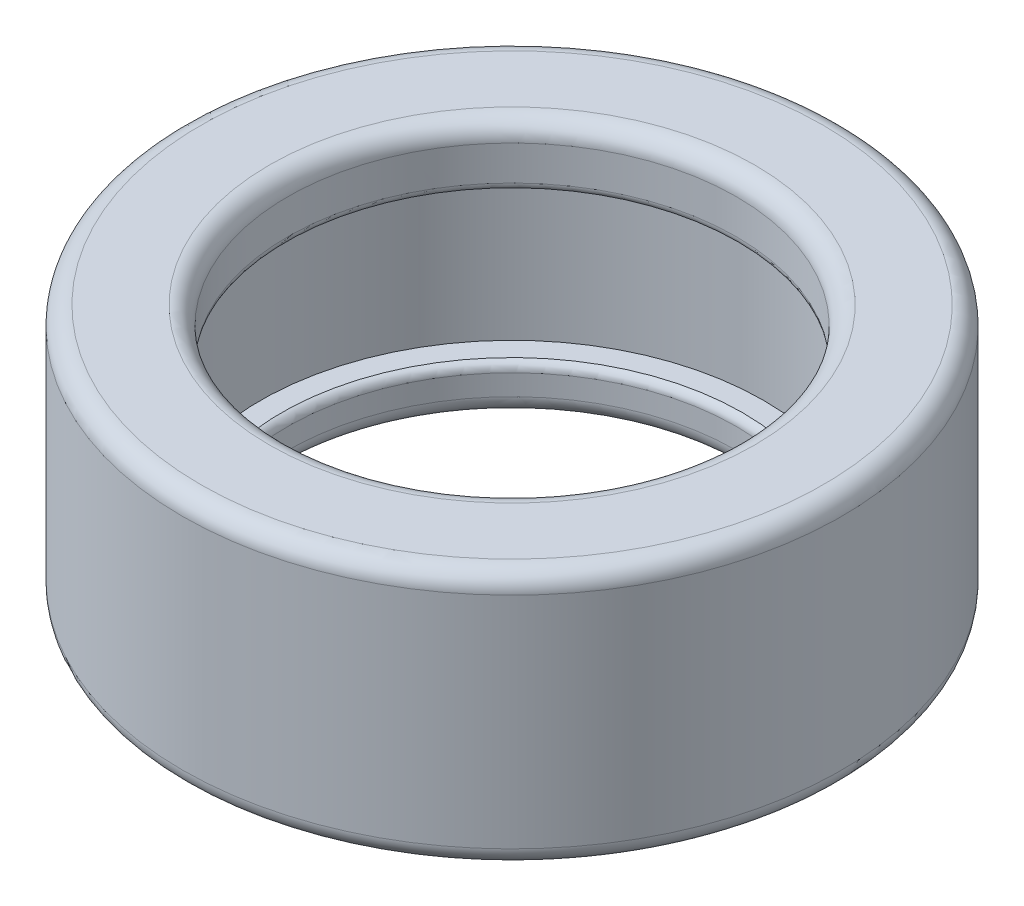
ISO-10303-21;
HEADER;
FILE_DESCRIPTION(('STEP AP214'),'2;1');
FILE_NAME('part.step','',(''),(''),'','','');
FILE_SCHEMA(('AUTOMOTIVE_DESIGN { 1 0 10303 214 1 1 1 1 }'));
ENDSEC;
DATA;
#1=APPLICATION_CONTEXT('core data for automotive mechanical design processes');
#2=APPLICATION_PROTOCOL_DEFINITION('international standard','automotive_design',2000,#1);
#3=PRODUCT_CONTEXT('',#1,'mechanical');
#4=PRODUCT('Part','Part','',(#3));
#5=PRODUCT_RELATED_PRODUCT_CATEGORY('part','',(#4));
#6=PRODUCT_DEFINITION_FORMATION('','',#4);
#7=PRODUCT_DEFINITION_CONTEXT('part definition',#1,'design');
#8=PRODUCT_DEFINITION('design','',#6,#7);
#9=PRODUCT_DEFINITION_SHAPE('','',#8);
#10=(LENGTH_UNIT() NAMED_UNIT(*) SI_UNIT(.MILLI.,.METRE.));
#11=(NAMED_UNIT(*) PLANE_ANGLE_UNIT() SI_UNIT($,.RADIAN.));
#12=(NAMED_UNIT(*) SI_UNIT($,.STERADIAN.) SOLID_ANGLE_UNIT());
#13=UNCERTAINTY_MEASURE_WITH_UNIT(LENGTH_MEASURE(1.E-05),#10,'distance_accuracy_value','');
#14=(GEOMETRIC_REPRESENTATION_CONTEXT(3) GLOBAL_UNCERTAINTY_ASSIGNED_CONTEXT((#13)) GLOBAL_UNIT_ASSIGNED_CONTEXT((#10,
#11,#12)) REPRESENTATION_CONTEXT('',''));
#15=CARTESIAN_POINT('',(0.,0.,0.));
#16=DIRECTION('',(0.,0.,1.));
#17=DIRECTION('',(1.,0.,0.));
#18=AXIS2_PLACEMENT_3D('',#15,#16,#17);
#19=CARTESIAN_POINT('',(0.,14.,0.));
#20=DIRECTION('',(0.,-1.,0.));
#21=DIRECTION('',(0.,0.,-1.));
#22=AXIS2_PLACEMENT_3D('',#19,#20,#21);
#23=CYLINDRICAL_SURFACE('',#22,18.);
#24=CARTESIAN_POINT('',(0.,13.,0.));
#25=DIRECTION('',(0.,1.,0.));
#26=DIRECTION('',(0.,0.,1.));
#27=AXIS2_PLACEMENT_3D('',#24,#25,#26);
#28=CIRCLE('',#27,18.);
#29=CARTESIAN_POINT('',(0.,13.,18.));
#30=VERTEX_POINT('',#29);
#31=EDGE_CURVE('E60',#30,#30,#28,.F.);
#32=ORIENTED_EDGE('',*,*,#31,.T.);
#33=EDGE_LOOP('',(#32));
#34=FACE_BOUND('',#33,.T.);
#35=CARTESIAN_POINT('',(0.,0.999999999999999,0.));
#36=DIRECTION('',(0.,1.,0.));
#37=DIRECTION('',(0.,0.,1.));
#38=AXIS2_PLACEMENT_3D('',#35,#36,#37);
#39=CIRCLE('',#38,18.);
#40=CARTESIAN_POINT('',(0.,0.999999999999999,18.));
#41=VERTEX_POINT('',#40);
#42=EDGE_CURVE('E63',#41,#41,#39,.T.);
#43=ORIENTED_EDGE('',*,*,#42,.T.);
#44=EDGE_LOOP('',(#43));
#45=FACE_BOUND('',#44,.T.);
#46=ADVANCED_FACE('F37',(#34,#45),#23,.T.);
#47=CARTESIAN_POINT('',(0.,14.,0.));
#48=DIRECTION('',(0.,1.,0.));
#49=DIRECTION('',(0.,0.,1.));
#50=AXIS2_PLACEMENT_3D('',#47,#48,#49);
#51=PLANE('',#50);
#52=CARTESIAN_POINT('',(0.,14.,0.));
#53=DIRECTION('',(0.,1.,0.));
#54=DIRECTION('',(0.,0.,1.));
#55=AXIS2_PLACEMENT_3D('',#52,#53,#54);
#56=CIRCLE('',#55,13.25);
#57=CARTESIAN_POINT('',(0.,14.,13.25));
#58=VERTEX_POINT('',#57);
#59=EDGE_CURVE('E52',#58,#58,#56,.F.);
#60=ORIENTED_EDGE('',*,*,#59,.T.);
#61=EDGE_LOOP('',(#60));
#62=FACE_BOUND('',#61,.T.);
#63=CARTESIAN_POINT('',(0.,14.,0.));
#64=DIRECTION('',(0.,1.,0.));
#65=DIRECTION('',(0.,0.,1.));
#66=AXIS2_PLACEMENT_3D('',#63,#64,#65);
#67=CIRCLE('',#66,17.);
#68=CARTESIAN_POINT('',(0.,14.,17.));
#69=VERTEX_POINT('',#68);
#70=EDGE_CURVE('E66',#69,#69,#67,.T.);
#71=ORIENTED_EDGE('',*,*,#70,.T.);
#72=EDGE_LOOP('',(#71));
#73=FACE_BOUND('',#72,.T.);
#74=ADVANCED_FACE('F103',(#62,#73),#51,.T.);
#75=CARTESIAN_POINT('',(0.,0.,0.));
#76=DIRECTION('',(0.,1.,0.));
#77=DIRECTION('',(0.,0.,1.));
#78=AXIS2_PLACEMENT_3D('',#75,#76,#77);
#79=PLANE('',#78);
#80=CARTESIAN_POINT('',(0.,0.,0.));
#81=DIRECTION('',(0.,1.,0.));
#82=DIRECTION('',(0.,0.,1.));
#83=AXIS2_PLACEMENT_3D('',#80,#81,#82);
#84=CIRCLE('',#83,13.25);
#85=CARTESIAN_POINT('',(0.,0.,13.25));
#86=VERTEX_POINT('',#85);
#87=EDGE_CURVE('E10',#86,#86,#84,.T.);
#88=ORIENTED_EDGE('',*,*,#87,.T.);
#89=EDGE_LOOP('',(#88));
#90=FACE_BOUND('',#89,.T.);
#91=CARTESIAN_POINT('',(0.,0.,0.));
#92=DIRECTION('',(0.,1.,0.));
#93=DIRECTION('',(0.,0.,1.));
#94=AXIS2_PLACEMENT_3D('',#91,#92,#93);
#95=CIRCLE('',#94,17.);
#96=CARTESIAN_POINT('',(0.,0.,17.));
#97=VERTEX_POINT('',#96);
#98=EDGE_CURVE('E57',#97,#97,#95,.F.);
#99=ORIENTED_EDGE('',*,*,#98,.T.);
#100=EDGE_LOOP('',(#99));
#101=FACE_BOUND('',#100,.T.);
#102=ADVANCED_FACE('F109',(#90,#101),#79,.F.);
#103=CARTESIAN_POINT('',(0.,0.607364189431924,0.));
#104=DIRECTION('',(0.,1.,0.));
#105=DIRECTION('',(0.,0.,-1.));
#106=AXIS2_PLACEMENT_3D('',#103,#104,#105);
#107=CYLINDRICAL_SURFACE('',#106,12.25);
#108=CARTESIAN_POINT('',(0.,13.,0.));
#109=DIRECTION('',(0.,1.,0.));
#110=DIRECTION('',(0.,0.,1.));
#111=AXIS2_PLACEMENT_3D('',#108,#109,#110);
#112=CIRCLE('',#111,12.25);
#113=CARTESIAN_POINT('',(0.,13.,12.25));
#114=VERTEX_POINT('',#113);
#115=EDGE_CURVE('E48',#114,#114,#112,.T.);
#116=ORIENTED_EDGE('',*,*,#115,.T.);
#117=EDGE_LOOP('',(#116));
#118=FACE_BOUND('',#117,.T.);
#119=CARTESIAN_POINT('',(0.,11.1073641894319,0.));
#120=DIRECTION('',(0.,1.,0.));
#121=DIRECTION('',(0.,0.,-1.));
#122=AXIS2_PLACEMENT_3D('',#119,#120,#121);
#123=CIRCLE('',#122,12.25);
#124=CARTESIAN_POINT('',(0.,11.1073641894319,-12.25));
#125=VERTEX_POINT('',#124);
#126=EDGE_CURVE('E72',#125,#125,#123,.T.);
#127=ORIENTED_EDGE('',*,*,#126,.F.);
#128=EDGE_LOOP('',(#127));
#129=FACE_BOUND('',#128,.T.);
#130=ADVANCED_FACE('F137',(#118,#129),#107,.F.);
#131=CARTESIAN_POINT('',(0.,1.,0.));
#132=DIRECTION('',(0.,1.,0.));
#133=DIRECTION('',(0.,0.,1.));
#134=AXIS2_PLACEMENT_3D('',#131,#132,#133);
#135=CIRCLE('',#134,12.25);
#136=CARTESIAN_POINT('',(0.,1.,12.25));
#137=VERTEX_POINT('',#136);
#138=EDGE_CURVE('E44',#137,#137,#135,.F.);
#139=ORIENTED_EDGE('',*,*,#138,.T.);
#140=EDGE_LOOP('',(#139));
#141=FACE_BOUND('',#140,.T.);
#142=CARTESIAN_POINT('',(0.,2.13189837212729,0.));
#143=DIRECTION('',(0.,1.,0.));
#144=DIRECTION('',(0.,0.,-1.));
#145=AXIS2_PLACEMENT_3D('',#142,#143,#144);
#146=CIRCLE('',#145,12.25);
#147=CARTESIAN_POINT('',(0.,2.13189837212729,-12.25));
#148=VERTEX_POINT('',#147);
#149=EDGE_CURVE('E69',#148,#148,#146,.F.);
#150=ORIENTED_EDGE('',*,*,#149,.F.);
#151=EDGE_LOOP('',(#150));
#152=FACE_BOUND('',#151,.T.);
#153=ADVANCED_FACE('F140',(#141,#152),#107,.F.);
#154=CARTESIAN_POINT('',(0.,11.1073641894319,0.));
#155=DIRECTION('',(0.,1.,0.));
#156=DIRECTION('',(0.,0.,-1.));
#157=AXIS2_PLACEMENT_3D('',#154,#155,#156);
#158=TOROIDAL_SURFACE('',#157,12.75,0.5);
#159=CARTESIAN_POINT('',(0.,10.8161085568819,0.));
#160=DIRECTION('',(0.,-1.,0.));
#161=DIRECTION('',(0.,0.,-1.));
#162=AXIS2_PLACEMENT_3D('',#159,#160,#161);
#163=CIRCLE('',#162,12.3435886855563);
#164=CARTESIAN_POINT('',(0.,10.8161085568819,-12.3435886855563));
#165=VERTEX_POINT('',#164);
#166=EDGE_CURVE('E78',#165,#165,#163,.F.);
#167=ORIENTED_EDGE('',*,*,#166,.F.);
#168=EDGE_LOOP('',(#167));
#169=FACE_BOUND('',#168,.T.);
#170=ORIENTED_EDGE('',*,*,#126,.T.);
#171=EDGE_LOOP('',(#170));
#172=FACE_BOUND('',#171,.T.);
#173=ADVANCED_FACE('F143',(#169,#172),#158,.T.);
#174=CARTESIAN_POINT('',(0.,2.13189837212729,0.));
#175=DIRECTION('',(0.,1.,0.));
#176=DIRECTION('',(0.,0.,-1.));
#177=AXIS2_PLACEMENT_3D('',#174,#175,#176);
#178=TOROIDAL_SURFACE('',#177,12.75,0.5);
#179=CARTESIAN_POINT('',(0.,2.60736418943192,0.));
#180=DIRECTION('',(0.,-1.,0.));
#181=DIRECTION('',(0.,0.,1.));
#182=AXIS2_PLACEMENT_3D('',#179,#180,#181);
#183=CIRCLE('',#182,12.5952994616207);
#184=CARTESIAN_POINT('',(0.,2.60736418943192,12.5952994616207));
#185=VERTEX_POINT('',#184);
#186=EDGE_CURVE('E75',#185,#185,#183,.T.);
#187=ORIENTED_EDGE('',*,*,#186,.F.);
#188=EDGE_LOOP('',(#187));
#189=FACE_BOUND('',#188,.T.);
#190=ORIENTED_EDGE('',*,*,#149,.T.);
#191=EDGE_LOOP('',(#190));
#192=FACE_BOUND('',#191,.T.);
#193=ADVANCED_FACE('F119',(#189,#192),#178,.T.);
#194=CARTESIAN_POINT('',(0.,13.,0.));
#195=DIRECTION('',(0.,1.,0.));
#196=DIRECTION('',(0.,0.,1.));
#197=AXIS2_PLACEMENT_3D('',#194,#195,#196);
#198=TOROIDAL_SURFACE('',#197,17.,1.);
#199=ORIENTED_EDGE('',*,*,#31,.F.);
#200=EDGE_LOOP('',(#199));
#201=FACE_BOUND('',#200,.T.);
#202=ORIENTED_EDGE('',*,*,#70,.F.);
#203=EDGE_LOOP('',(#202));
#204=FACE_BOUND('',#203,.T.);
#205=ADVANCED_FACE('F115',(#201,#204),#198,.T.);
#206=CARTESIAN_POINT('',(0.,0.999999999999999,0.));
#207=DIRECTION('',(0.,1.,0.));
#208=DIRECTION('',(0.,0.,1.));
#209=AXIS2_PLACEMENT_3D('',#206,#207,#208);
#210=TOROIDAL_SURFACE('',#209,17.,1.);
#211=ORIENTED_EDGE('',*,*,#98,.F.);
#212=EDGE_LOOP('',(#211));
#213=FACE_BOUND('',#212,.T.);
#214=ORIENTED_EDGE('',*,*,#42,.F.);
#215=EDGE_LOOP('',(#214));
#216=FACE_BOUND('',#215,.T.);
#217=ADVANCED_FACE('F118',(#213,#216),#210,.T.);
#218=CARTESIAN_POINT('',(0.,13.,0.));
#219=DIRECTION('',(0.,1.,0.));
#220=DIRECTION('',(0.,0.,1.));
#221=AXIS2_PLACEMENT_3D('',#218,#219,#220);
#222=TOROIDAL_SURFACE('',#221,13.25,1.);
#223=ORIENTED_EDGE('',*,*,#115,.F.);
#224=EDGE_LOOP('',(#223));
#225=FACE_BOUND('',#224,.T.);
#226=ORIENTED_EDGE('',*,*,#59,.F.);
#227=EDGE_LOOP('',(#226));
#228=FACE_BOUND('',#227,.T.);
#229=ADVANCED_FACE('F122',(#225,#228),#222,.T.);
#230=CARTESIAN_POINT('',(0.,1.,0.));
#231=DIRECTION('',(0.,1.,0.));
#232=DIRECTION('',(0.,0.,1.));
#233=AXIS2_PLACEMENT_3D('',#230,#231,#232);
#234=TOROIDAL_SURFACE('',#233,13.25,1.);
#235=ORIENTED_EDGE('',*,*,#87,.F.);
#236=EDGE_LOOP('',(#235));
#237=FACE_BOUND('',#236,.T.);
#238=ORIENTED_EDGE('',*,*,#138,.F.);
#239=EDGE_LOOP('',(#238));
#240=FACE_BOUND('',#239,.T.);
#241=ADVANCED_FACE('F39',(#237,#240),#234,.T.);
#242=CARTESIAN_POINT('',(0.,10.8161085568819,0.));
#243=DIRECTION('',(0.,1.,0.));
#244=DIRECTION('',(0.,0.,1.));
#245=AXIS2_PLACEMENT_3D('',#242,#243,#244);
#246=PLANE('',#245);
#247=ORIENTED_EDGE('',*,*,#166,.T.);
#248=EDGE_LOOP('',(#247));
#249=FACE_BOUND('',#248,.T.);
#250=CARTESIAN_POINT('',(0.,10.8161085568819,0.));
#251=DIRECTION('',(0.,1.,0.));
#252=DIRECTION('',(0.,0.,1.));
#253=AXIS2_PLACEMENT_3D('',#250,#251,#252);
#254=CIRCLE('',#253,13.75);
#255=CARTESIAN_POINT('',(0.,10.8161085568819,13.75));
#256=VERTEX_POINT('',#255);
#257=EDGE_CURVE('E81',#256,#256,#254,.T.);
#258=ORIENTED_EDGE('',*,*,#257,.F.);
#259=EDGE_LOOP('',(#258));
#260=FACE_BOUND('',#259,.T.);
#261=ADVANCED_FACE('F97',(#249,#260),#246,.F.);
#262=CARTESIAN_POINT('',(0.,2.60736418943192,0.));
#263=DIRECTION('',(0.,1.,0.));
#264=DIRECTION('',(0.,0.,1.));
#265=AXIS2_PLACEMENT_3D('',#262,#263,#264);
#266=PLANE('',#265);
#267=ORIENTED_EDGE('',*,*,#186,.T.);
#268=EDGE_LOOP('',(#267));
#269=FACE_BOUND('',#268,.T.);
#270=CARTESIAN_POINT('',(0.,2.60736418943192,0.));
#271=DIRECTION('',(0.,1.,0.));
#272=DIRECTION('',(0.,0.,1.));
#273=AXIS2_PLACEMENT_3D('',#270,#271,#272);
#274=CIRCLE('',#273,13.75);
#275=CARTESIAN_POINT('',(0.,2.60736418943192,13.75));
#276=VERTEX_POINT('',#275);
#277=EDGE_CURVE('E84',#276,#276,#274,.T.);
#278=ORIENTED_EDGE('',*,*,#277,.T.);
#279=EDGE_LOOP('',(#278));
#280=FACE_BOUND('',#279,.T.);
#281=ADVANCED_FACE('F88',(#269,#280),#266,.T.);
#282=CARTESIAN_POINT('',(0.,11.1073641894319,0.));
#283=DIRECTION('',(0.,-1.,0.));
#284=DIRECTION('',(0.,0.,1.));
#285=AXIS2_PLACEMENT_3D('',#282,#283,#284);
#286=CYLINDRICAL_SURFACE('',#285,13.75);
#287=ORIENTED_EDGE('',*,*,#257,.T.);
#288=EDGE_LOOP('',(#287));
#289=FACE_BOUND('',#288,.T.);
#290=ORIENTED_EDGE('',*,*,#277,.F.);
#291=EDGE_LOOP('',(#290));
#292=FACE_BOUND('',#291,.T.);
#293=ADVANCED_FACE('F90',(#289,#292),#286,.F.);
#294=CLOSED_SHELL('',(#46,#74,#102,#130,#153,#173,#193,#205,#217,#229,#241,#261,#281,#293));
#295=MANIFOLD_SOLID_BREP('B2',#294);
#296=ADVANCED_BREP_SHAPE_REPRESENTATION('',(#18,#295),#14);
#297=SHAPE_DEFINITION_REPRESENTATION(#9,#296);
ENDSEC;
END-ISO-10303-21;
